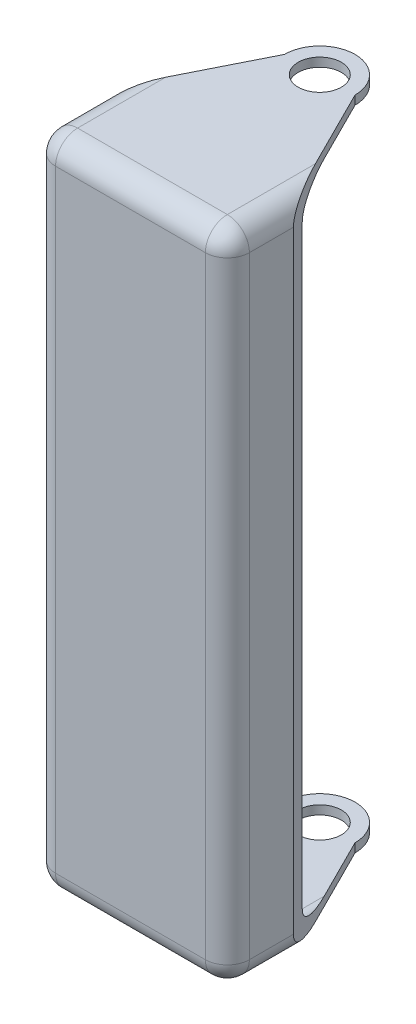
ISO-10303-21;
HEADER;
FILE_DESCRIPTION(('STEP AP214'),'2;1');
FILE_NAME('part.step','',(''),(''),'','','');
FILE_SCHEMA(('AUTOMOTIVE_DESIGN { 1 0 10303 214 1 1 1 1 }'));
ENDSEC;
DATA;
#1=APPLICATION_CONTEXT('core data for automotive mechanical design processes');
#2=APPLICATION_PROTOCOL_DEFINITION('international standard','automotive_design',2000,#1);
#3=PRODUCT_CONTEXT('',#1,'mechanical');
#4=PRODUCT('Part','Part','',(#3));
#5=PRODUCT_RELATED_PRODUCT_CATEGORY('part','',(#4));
#6=PRODUCT_DEFINITION_FORMATION('','',#4);
#7=PRODUCT_DEFINITION_CONTEXT('part definition',#1,'design');
#8=PRODUCT_DEFINITION('design','',#6,#7);
#9=PRODUCT_DEFINITION_SHAPE('','',#8);
#10=(LENGTH_UNIT() NAMED_UNIT(*) SI_UNIT(.MILLI.,.METRE.));
#11=(NAMED_UNIT(*) PLANE_ANGLE_UNIT() SI_UNIT($,.RADIAN.));
#12=(NAMED_UNIT(*) SI_UNIT($,.STERADIAN.) SOLID_ANGLE_UNIT());
#13=UNCERTAINTY_MEASURE_WITH_UNIT(LENGTH_MEASURE(1.E-05),#10,'distance_accuracy_value','');
#14=(GEOMETRIC_REPRESENTATION_CONTEXT(3) GLOBAL_UNCERTAINTY_ASSIGNED_CONTEXT((#13)) GLOBAL_UNIT_ASSIGNED_CONTEXT((#10,
#11,#12)) REPRESENTATION_CONTEXT('',''));
#15=CARTESIAN_POINT('',(0.,0.,0.));
#16=DIRECTION('',(0.,0.,1.));
#17=DIRECTION('',(1.,0.,0.));
#18=AXIS2_PLACEMENT_3D('',#15,#16,#17);
#19=CARTESIAN_POINT('',(20.3226286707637,184.15,5.88214452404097));
#20=DIRECTION('',(-0.894242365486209,0.,0.447583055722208));
#21=DIRECTION('',(0.447583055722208,0.,0.894242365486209));
#22=AXIS2_PLACEMENT_3D('',#19,#20,#21);
#23=PLANE('',#22);
#24=DIRECTION('',(0.,-1.,0.));
#25=VECTOR('',#24,1.);
#26=CARTESIAN_POINT('',(22.8626286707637,184.15,10.9569023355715));
#27=LINE('',#26,#25);
#28=CARTESIAN_POINT('',(22.8626286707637,180.34,10.9569023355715));
#29=VERTEX_POINT('',#28);
#30=CARTESIAN_POINT('',(22.8626286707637,3.81000000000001,10.9569023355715));
#31=VERTEX_POINT('',#30);
#32=EDGE_CURVE('E222',#29,#31,#27,.T.);
#33=ORIENTED_EDGE('',*,*,#32,.T.);
#34=CARTESIAN_POINT('',(16.5126286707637,3.81000000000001,-1.72999219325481));
#35=DIRECTION('',(-0.894242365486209,0.,0.447583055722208));
#36=DIRECTION('',(-0.447583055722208,0.,-0.894242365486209));
#37=AXIS2_PLACEMENT_3D('',#34,#35,#36);
#38=ELLIPSE('',#37,14.1873109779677,6.35);
#39=CARTESIAN_POINT('',(16.5126286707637,-2.53999999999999,-1.72999219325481));
#40=VERTEX_POINT('',#39);
#41=EDGE_CURVE('E327',#31,#40,#38,.F.);
#42=ORIENTED_EDGE('',*,*,#41,.T.);
#43=DIRECTION('',(-0.447583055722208,0.,-0.894242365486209));
#44=VECTOR('',#43,1.);
#45=CARTESIAN_POINT('',(20.3226286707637,-2.53999999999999,5.88214452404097));
#46=LINE('',#45,#44);
#47=CARTESIAN_POINT('',(5.08262867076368,-2.53999999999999,-24.5664023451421));
#48=VERTEX_POINT('',#47);
#49=EDGE_CURVE('E232',#40,#48,#46,.T.);
#50=ORIENTED_EDGE('',*,*,#49,.T.);
#51=DIRECTION('',(0.,-1.,0.));
#52=VECTOR('',#51,1.);
#53=CARTESIAN_POINT('',(5.08262867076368,184.15,-24.5664023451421));
#54=LINE('',#53,#52);
#55=CARTESIAN_POINT('',(5.08262867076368,0.,-24.5664023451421));
#56=VERTEX_POINT('',#55);
#57=EDGE_CURVE('E223',#56,#48,#54,.T.);
#58=ORIENTED_EDGE('',*,*,#57,.F.);
#59=DIRECTION('',(-0.447583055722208,0.,-0.894242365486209));
#60=VECTOR('',#59,1.);
#61=CARTESIAN_POINT('',(20.3226286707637,0.,5.88214452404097));
#62=LINE('',#61,#60);
#63=CARTESIAN_POINT('',(13.9726286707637,0.,-6.80475000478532));
#64=VERTEX_POINT('',#63);
#65=EDGE_CURVE('E459',#64,#56,#62,.T.);
#66=ORIENTED_EDGE('',*,*,#65,.F.);
#67=CARTESIAN_POINT('',(13.9726286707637,6.35,-6.80475000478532));
#68=DIRECTION('',(-0.894242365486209,0.,0.447583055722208));
#69=DIRECTION('',(0.447583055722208,0.,0.894242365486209));
#70=AXIS2_PLACEMENT_3D('',#67,#68,#69);
#71=ELLIPSE('',#70,14.1873109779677,6.35);
#72=CARTESIAN_POINT('',(20.3226286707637,6.34999999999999,5.88214452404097));
#73=VERTEX_POINT('',#72);
#74=EDGE_CURVE('E44',#64,#73,#71,.T.);
#75=ORIENTED_EDGE('',*,*,#74,.T.);
#76=DIRECTION('',(0.,-1.,0.));
#77=VECTOR('',#76,1.);
#78=CARTESIAN_POINT('',(20.3226286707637,184.15,5.88214452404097));
#79=LINE('',#78,#77);
#80=CARTESIAN_POINT('',(20.3226286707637,177.8,5.88214452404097));
#81=VERTEX_POINT('',#80);
#82=EDGE_CURVE('E235',#81,#73,#79,.T.);
#83=ORIENTED_EDGE('',*,*,#82,.F.);
#84=CARTESIAN_POINT('',(13.9726286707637,177.8,-6.80475000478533));
#85=DIRECTION('',(-0.894242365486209,0.,0.447583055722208));
#86=DIRECTION('',(-0.447583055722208,0.,-0.894242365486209));
#87=AXIS2_PLACEMENT_3D('',#84,#85,#86);
#88=ELLIPSE('',#87,14.1873109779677,6.35);
#89=CARTESIAN_POINT('',(13.9726286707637,184.15,-6.80475000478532));
#90=VERTEX_POINT('',#89);
#91=EDGE_CURVE('E206',#81,#90,#88,.T.);
#92=ORIENTED_EDGE('',*,*,#91,.T.);
#93=DIRECTION('',(-0.447583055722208,0.,-0.894242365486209));
#94=VECTOR('',#93,1.);
#95=CARTESIAN_POINT('',(20.3226286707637,184.15,5.88214452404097));
#96=LINE('',#95,#94);
#97=CARTESIAN_POINT('',(5.08262867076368,184.15,-24.5664023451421));
#98=VERTEX_POINT('',#97);
#99=EDGE_CURVE('E197',#90,#98,#96,.T.);
#100=ORIENTED_EDGE('',*,*,#99,.T.);
#101=CARTESIAN_POINT('',(5.08262867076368,186.69,-24.5664023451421));
#102=VERTEX_POINT('',#101);
#103=EDGE_CURVE('E202',#102,#98,#54,.T.);
#104=ORIENTED_EDGE('',*,*,#103,.F.);
#105=DIRECTION('',(-0.447583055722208,0.,-0.894242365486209));
#106=VECTOR('',#105,1.);
#107=CARTESIAN_POINT('',(20.3226286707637,186.69,5.88214452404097));
#108=LINE('',#107,#106);
#109=CARTESIAN_POINT('',(16.5126286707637,186.69,-1.72999219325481));
#110=VERTEX_POINT('',#109);
#111=EDGE_CURVE('E241',#110,#102,#108,.T.);
#112=ORIENTED_EDGE('',*,*,#111,.F.);
#113=CARTESIAN_POINT('',(16.5126286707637,180.34,-1.72999219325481));
#114=DIRECTION('',(-0.894242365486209,0.,0.447583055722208));
#115=DIRECTION('',(0.447583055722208,0.,0.894242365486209));
#116=AXIS2_PLACEMENT_3D('',#113,#114,#115);
#117=ELLIPSE('',#116,14.1873109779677,6.35);
#118=EDGE_CURVE('E325',#110,#29,#117,.F.);
#119=ORIENTED_EDGE('',*,*,#118,.T.);
#120=EDGE_LOOP('',(#33,#42,#50,#58,#66,#75,#83,#92,#100,#104,#112,#119));
#121=FACE_BOUND('',#120,.T.);
#122=ADVANCED_FACE('F35',(#121),#23,.F.);
#123=CARTESIAN_POINT('',(-5.07737132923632,184.15,-24.5664023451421));
#124=DIRECTION('',(0.,-1.,0.));
#125=DIRECTION('',(0.,0.,-1.));
#126=AXIS2_PLACEMENT_3D('',#123,#124,#125);
#127=CYLINDRICAL_SURFACE('',#126,10.16);
#128=CARTESIAN_POINT('',(-5.07737132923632,0.,-24.5664023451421));
#129=DIRECTION('',(0.,1.,0.));
#130=DIRECTION('',(0.,0.,1.));
#131=AXIS2_PLACEMENT_3D('',#128,#129,#130);
#132=CIRCLE('',#131,10.16);
#133=CARTESIAN_POINT('',(-15.2373713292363,0.,-24.5664023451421));
#134=VERTEX_POINT('',#133);
#135=EDGE_CURVE('E455',#56,#134,#132,.T.);
#136=ORIENTED_EDGE('',*,*,#135,.F.);
#137=ORIENTED_EDGE('',*,*,#57,.T.);
#138=CARTESIAN_POINT('',(-5.07737132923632,-2.53999999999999,-24.5664023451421));
#139=DIRECTION('',(0.,1.,0.));
#140=DIRECTION('',(0.,0.,1.));
#141=AXIS2_PLACEMENT_3D('',#138,#139,#140);
#142=CIRCLE('',#141,10.16);
#143=CARTESIAN_POINT('',(-15.2373713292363,-2.53999999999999,-24.5664023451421));
#144=VERTEX_POINT('',#143);
#145=EDGE_CURVE('E234',#48,#144,#142,.T.);
#146=ORIENTED_EDGE('',*,*,#145,.T.);
#147=DIRECTION('',(0.,-1.,0.));
#148=VECTOR('',#147,1.);
#149=CARTESIAN_POINT('',(-15.2373713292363,184.15,-24.5664023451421));
#150=LINE('',#149,#148);
#151=EDGE_CURVE('E245',#134,#144,#150,.T.);
#152=ORIENTED_EDGE('',*,*,#151,.F.);
#153=EDGE_LOOP('',(#136,#137,#146,#152));
#154=FACE_BOUND('',#153,.T.);
#155=ADVANCED_FACE('F453',(#154),#127,.T.);
#156=CARTESIAN_POINT('',(-15.2373713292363,184.15,-24.5664023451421));
#157=DIRECTION('',(0.894242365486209,0.,0.447583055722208));
#158=DIRECTION('',(0.447583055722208,0.,-0.894242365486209));
#159=AXIS2_PLACEMENT_3D('',#156,#157,#158);
#160=PLANE('',#159);
#161=DIRECTION('',(0.,-1.,0.));
#162=VECTOR('',#161,1.);
#163=CARTESIAN_POINT('',(-33.0173713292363,184.15,10.9569023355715));
#164=LINE('',#163,#162);
#165=CARTESIAN_POINT('',(-33.0173713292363,180.34,10.9569023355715));
#166=VERTEX_POINT('',#165);
#167=CARTESIAN_POINT('',(-33.0173713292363,3.81000000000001,10.9569023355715));
#168=VERTEX_POINT('',#167);
#169=EDGE_CURVE('E242',#166,#168,#164,.T.);
#170=ORIENTED_EDGE('',*,*,#169,.F.);
#171=CARTESIAN_POINT('',(-26.6673713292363,180.34,-1.7299921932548));
#172=DIRECTION('',(0.894242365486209,0.,0.447583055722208));
#173=DIRECTION('',(0.447583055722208,0.,-0.894242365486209));
#174=AXIS2_PLACEMENT_3D('',#171,#172,#173);
#175=ELLIPSE('',#174,14.1873109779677,6.35);
#176=CARTESIAN_POINT('',(-26.6673713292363,186.69,-1.7299921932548));
#177=VERTEX_POINT('',#176);
#178=EDGE_CURVE('E323',#166,#177,#175,.F.);
#179=ORIENTED_EDGE('',*,*,#178,.T.);
#180=DIRECTION('',(-0.447583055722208,0.,0.894242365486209));
#181=VECTOR('',#180,1.);
#182=CARTESIAN_POINT('',(-15.2373713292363,186.69,-24.5664023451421));
#183=LINE('',#182,#181);
#184=CARTESIAN_POINT('',(-15.2373713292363,186.69,-24.5664023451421));
#185=VERTEX_POINT('',#184);
#186=EDGE_CURVE('E246',#185,#177,#183,.T.);
#187=ORIENTED_EDGE('',*,*,#186,.F.);
#188=CARTESIAN_POINT('',(-15.2373713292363,184.15,-24.5664023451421));
#189=VERTEX_POINT('',#188);
#190=EDGE_CURVE('E228',#185,#189,#150,.T.);
#191=ORIENTED_EDGE('',*,*,#190,.T.);
#192=DIRECTION('',(-0.447583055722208,0.,0.894242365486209));
#193=VECTOR('',#192,1.);
#194=CARTESIAN_POINT('',(-15.2373713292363,184.15,-24.5664023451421));
#195=LINE('',#194,#193);
#196=CARTESIAN_POINT('',(-24.1273713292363,184.15,-6.80475000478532));
#197=VERTEX_POINT('',#196);
#198=EDGE_CURVE('E215',#189,#197,#195,.T.);
#199=ORIENTED_EDGE('',*,*,#198,.T.);
#200=CARTESIAN_POINT('',(-24.1273713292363,177.8,-6.80475000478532));
#201=DIRECTION('',(0.894242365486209,0.,0.447583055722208));
#202=DIRECTION('',(-0.447583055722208,0.,0.894242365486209));
#203=AXIS2_PLACEMENT_3D('',#200,#201,#202);
#204=ELLIPSE('',#203,14.1873109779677,6.35);
#205=CARTESIAN_POINT('',(-30.4773713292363,177.8,5.88214452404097));
#206=VERTEX_POINT('',#205);
#207=EDGE_CURVE('E11',#197,#206,#204,.T.);
#208=ORIENTED_EDGE('',*,*,#207,.T.);
#209=DIRECTION('',(0.,-1.,0.));
#210=VECTOR('',#209,1.);
#211=CARTESIAN_POINT('',(-30.4773713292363,184.15,5.88214452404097));
#212=LINE('',#211,#210);
#213=CARTESIAN_POINT('',(-30.4773713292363,6.34999999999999,5.88214452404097));
#214=VERTEX_POINT('',#213);
#215=EDGE_CURVE('E466',#206,#214,#212,.T.);
#216=ORIENTED_EDGE('',*,*,#215,.T.);
#217=CARTESIAN_POINT('',(-24.1273713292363,6.35,-6.80475000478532));
#218=DIRECTION('',(0.894242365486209,0.,0.447583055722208));
#219=DIRECTION('',(0.447583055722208,0.,-0.894242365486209));
#220=AXIS2_PLACEMENT_3D('',#217,#218,#219);
#221=ELLIPSE('',#220,14.1873109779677,6.35);
#222=CARTESIAN_POINT('',(-24.1273713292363,0.,-6.80475000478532));
#223=VERTEX_POINT('',#222);
#224=EDGE_CURVE('E330',#214,#223,#221,.T.);
#225=ORIENTED_EDGE('',*,*,#224,.T.);
#226=DIRECTION('',(-0.447583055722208,0.,0.894242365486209));
#227=VECTOR('',#226,1.);
#228=CARTESIAN_POINT('',(-15.2373713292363,0.,-24.5664023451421));
#229=LINE('',#228,#227);
#230=EDGE_CURVE('E210',#134,#223,#229,.T.);
#231=ORIENTED_EDGE('',*,*,#230,.F.);
#232=ORIENTED_EDGE('',*,*,#151,.T.);
#233=DIRECTION('',(-0.447583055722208,0.,0.894242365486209));
#234=VECTOR('',#233,1.);
#235=CARTESIAN_POINT('',(-15.2373713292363,-2.53999999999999,-24.5664023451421));
#236=LINE('',#235,#234);
#237=CARTESIAN_POINT('',(-26.6673713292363,-2.53999999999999,-1.7299921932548));
#238=VERTEX_POINT('',#237);
#239=EDGE_CURVE('E238',#144,#238,#236,.T.);
#240=ORIENTED_EDGE('',*,*,#239,.T.);
#241=CARTESIAN_POINT('',(-26.6673713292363,3.81000000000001,-1.7299921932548));
#242=DIRECTION('',(0.894242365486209,0.,0.447583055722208));
#243=DIRECTION('',(-0.447583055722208,0.,0.894242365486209));
#244=AXIS2_PLACEMENT_3D('',#241,#242,#243);
#245=ELLIPSE('',#244,14.1873109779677,6.35);
#246=EDGE_CURVE('E321',#238,#168,#245,.F.);
#247=ORIENTED_EDGE('',*,*,#246,.T.);
#248=EDGE_LOOP('',(#170,#179,#187,#191,#199,#208,#216,#225,#231,#232,#240,#247));
#249=FACE_BOUND('',#248,.T.);
#250=ADVANCED_FACE('F530',(#249),#160,.F.);
#251=CARTESIAN_POINT('',(22.8626286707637,184.15,5.88214452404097));
#252=DIRECTION('',(-1.,0.,0.));
#253=DIRECTION('',(0.,0.,1.));
#254=AXIS2_PLACEMENT_3D('',#251,#252,#253);
#255=PLANE('',#254);
#256=DIRECTION('',(0.,-1.,0.));
#257=VECTOR('',#256,1.);
#258=CARTESIAN_POINT('',(22.8626286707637,184.15,23.662144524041));
#259=LINE('',#258,#257);
#260=CARTESIAN_POINT('',(22.8626286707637,180.34,23.662144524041));
#261=VERTEX_POINT('',#260);
#262=CARTESIAN_POINT('',(22.8626286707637,3.81000000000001,23.662144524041));
#263=VERTEX_POINT('',#262);
#264=EDGE_CURVE('E52',#261,#263,#259,.T.);
#265=ORIENTED_EDGE('',*,*,#264,.T.);
#266=DIRECTION('',(0.,0.,-1.));
#267=VECTOR('',#266,1.);
#268=CARTESIAN_POINT('',(22.8626286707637,3.81000000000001,5.88214452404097));
#269=LINE('',#268,#267);
#270=EDGE_CURVE('E319',#263,#31,#269,.T.);
#271=ORIENTED_EDGE('',*,*,#270,.T.);
#272=ORIENTED_EDGE('',*,*,#32,.F.);
#273=DIRECTION('',(0.,0.,-1.));
#274=VECTOR('',#273,1.);
#275=CARTESIAN_POINT('',(22.8626286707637,180.34,30.012144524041));
#276=LINE('',#275,#274);
#277=EDGE_CURVE('E57',#29,#261,#276,.F.);
#278=ORIENTED_EDGE('',*,*,#277,.T.);
#279=EDGE_LOOP('',(#265,#271,#272,#278));
#280=FACE_BOUND('',#279,.T.);
#281=ADVANCED_FACE('F429',(#280),#255,.F.);
#282=ORIENTED_EDGE('',*,*,#103,.T.);
#283=CARTESIAN_POINT('',(-5.07737132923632,184.15,-24.5664023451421));
#284=DIRECTION('',(0.,1.,0.));
#285=DIRECTION('',(0.,0.,1.));
#286=AXIS2_PLACEMENT_3D('',#283,#284,#285);
#287=CIRCLE('',#286,10.16);
#288=EDGE_CURVE('E209',#98,#189,#287,.T.);
#289=ORIENTED_EDGE('',*,*,#288,.T.);
#290=ORIENTED_EDGE('',*,*,#190,.F.);
#291=CARTESIAN_POINT('',(-5.07737132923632,186.69,-24.5664023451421));
#292=DIRECTION('',(0.,1.,0.));
#293=DIRECTION('',(0.,0.,1.));
#294=AXIS2_PLACEMENT_3D('',#291,#292,#293);
#295=CIRCLE('',#294,10.16);
#296=EDGE_CURVE('E221',#102,#185,#295,.T.);
#297=ORIENTED_EDGE('',*,*,#296,.F.);
#298=EDGE_LOOP('',(#282,#289,#290,#297));
#299=FACE_BOUND('',#298,.T.);
#300=ADVANCED_FACE('F220',(#299),#127,.T.);
#301=CARTESIAN_POINT('',(-33.0173713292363,184.15,5.88214452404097));
#302=DIRECTION('',(1.,0.,0.));
#303=DIRECTION('',(0.,0.,-1.));
#304=AXIS2_PLACEMENT_3D('',#301,#302,#303);
#305=PLANE('',#304);
#306=DIRECTION('',(0.,-1.,0.));
#307=VECTOR('',#306,1.);
#308=CARTESIAN_POINT('',(-33.0173713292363,184.15,23.662144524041));
#309=LINE('',#308,#307);
#310=CARTESIAN_POINT('',(-33.0173713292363,3.81000000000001,23.662144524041));
#311=VERTEX_POINT('',#310);
#312=CARTESIAN_POINT('',(-33.0173713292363,180.34,23.662144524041));
#313=VERTEX_POINT('',#312);
#314=EDGE_CURVE('E307',#311,#313,#309,.F.);
#315=ORIENTED_EDGE('',*,*,#314,.T.);
#316=DIRECTION('',(0.,0.,1.));
#317=VECTOR('',#316,1.);
#318=CARTESIAN_POINT('',(-33.0173713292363,180.34,10.9569023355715));
#319=LINE('',#318,#317);
#320=EDGE_CURVE('E309',#313,#166,#319,.F.);
#321=ORIENTED_EDGE('',*,*,#320,.T.);
#322=ORIENTED_EDGE('',*,*,#169,.T.);
#323=DIRECTION('',(0.,0.,1.));
#324=VECTOR('',#323,1.);
#325=CARTESIAN_POINT('',(-33.0173713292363,3.81000000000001,5.88214452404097));
#326=LINE('',#325,#324);
#327=EDGE_CURVE('E305',#168,#311,#326,.T.);
#328=ORIENTED_EDGE('',*,*,#327,.T.);
#329=EDGE_LOOP('',(#315,#321,#322,#328));
#330=FACE_BOUND('',#329,.T.);
#331=ADVANCED_FACE('F557',(#330),#305,.F.);
#332=CARTESIAN_POINT('',(-30.4773713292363,184.15,30.012144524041));
#333=DIRECTION('',(0.,0.,-1.));
#334=DIRECTION('',(-1.,0.,0.));
#335=AXIS2_PLACEMENT_3D('',#332,#333,#334);
#336=PLANE('',#335);
#337=DIRECTION('',(0.,-1.,0.));
#338=VECTOR('',#337,1.);
#339=CARTESIAN_POINT('',(-26.6673713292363,184.15,30.012144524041));
#340=LINE('',#339,#338);
#341=CARTESIAN_POINT('',(-26.6673713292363,180.34,30.012144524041));
#342=VERTEX_POINT('',#341);
#343=CARTESIAN_POINT('',(-26.6673713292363,3.81000000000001,30.012144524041));
#344=VERTEX_POINT('',#343);
#345=EDGE_CURVE('E293',#342,#344,#340,.T.);
#346=ORIENTED_EDGE('',*,*,#345,.T.);
#347=DIRECTION('',(1.,0.,0.));
#348=VECTOR('',#347,1.);
#349=CARTESIAN_POINT('',(-30.4773713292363,3.81000000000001,30.012144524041));
#350=LINE('',#349,#348);
#351=CARTESIAN_POINT('',(16.5126286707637,3.81000000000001,30.012144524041));
#352=VERTEX_POINT('',#351);
#353=EDGE_CURVE('E295',#344,#352,#350,.T.);
#354=ORIENTED_EDGE('',*,*,#353,.T.);
#355=DIRECTION('',(0.,-1.,0.));
#356=VECTOR('',#355,1.);
#357=CARTESIAN_POINT('',(16.5126286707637,184.15,30.012144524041));
#358=LINE('',#357,#356);
#359=CARTESIAN_POINT('',(16.5126286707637,180.34,30.012144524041));
#360=VERTEX_POINT('',#359);
#361=EDGE_CURVE('E289',#352,#360,#358,.F.);
#362=ORIENTED_EDGE('',*,*,#361,.T.);
#363=DIRECTION('',(1.,0.,0.));
#364=VECTOR('',#363,1.);
#365=CARTESIAN_POINT('',(-33.0173713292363,180.34,30.012144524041));
#366=LINE('',#365,#364);
#367=EDGE_CURVE('E291',#360,#342,#366,.F.);
#368=ORIENTED_EDGE('',*,*,#367,.T.);
#369=EDGE_LOOP('',(#346,#354,#362,#368));
#370=FACE_BOUND('',#369,.T.);
#371=ADVANCED_FACE('F413',(#370),#336,.F.);
#372=CARTESIAN_POINT('',(-5.07737132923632,186.69,-24.5664023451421));
#373=DIRECTION('',(0.,1.,0.));
#374=DIRECTION('',(0.,0.,1.));
#375=AXIS2_PLACEMENT_3D('',#372,#373,#374);
#376=PLANE('',#375);
#377=CARTESIAN_POINT('',(-5.07737132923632,186.69,-24.5664023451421));
#378=DIRECTION('',(0.,1.,0.));
#379=DIRECTION('',(0.,0.,1.));
#380=AXIS2_PLACEMENT_3D('',#377,#378,#379);
#381=CIRCLE('',#380,6.22646089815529);
#382=CARTESIAN_POINT('',(-5.07737132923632,186.69,-18.3399414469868));
#383=VERTEX_POINT('',#382);
#384=EDGE_CURVE('E255',#383,#383,#381,.T.);
#385=ORIENTED_EDGE('',*,*,#384,.F.);
#386=EDGE_LOOP('',(#385));
#387=FACE_BOUND('',#386,.T.);
#388=ORIENTED_EDGE('',*,*,#186,.T.);
#389=DIRECTION('',(0.,0.,1.));
#390=VECTOR('',#389,1.);
#391=CARTESIAN_POINT('',(-26.6673713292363,186.69,30.012144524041));
#392=LINE('',#391,#390);
#393=CARTESIAN_POINT('',(-26.6673713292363,186.69,23.662144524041));
#394=VERTEX_POINT('',#393);
#395=EDGE_CURVE('E315',#177,#394,#392,.T.);
#396=ORIENTED_EDGE('',*,*,#395,.T.);
#397=DIRECTION('',(1.,0.,0.));
#398=VECTOR('',#397,1.);
#399=CARTESIAN_POINT('',(22.8626286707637,186.69,23.662144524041));
#400=LINE('',#399,#398);
#401=CARTESIAN_POINT('',(16.5126286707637,186.69,23.662144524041));
#402=VERTEX_POINT('',#401);
#403=EDGE_CURVE('E313',#394,#402,#400,.T.);
#404=ORIENTED_EDGE('',*,*,#403,.T.);
#405=DIRECTION('',(0.,0.,-1.));
#406=VECTOR('',#405,1.);
#407=CARTESIAN_POINT('',(16.5126286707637,186.69,10.9569023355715));
#408=LINE('',#407,#406);
#409=EDGE_CURVE('E311',#402,#110,#408,.T.);
#410=ORIENTED_EDGE('',*,*,#409,.T.);
#411=ORIENTED_EDGE('',*,*,#111,.T.);
#412=ORIENTED_EDGE('',*,*,#296,.T.);
#413=EDGE_LOOP('',(#388,#396,#404,#410,#411,#412));
#414=FACE_BOUND('',#413,.T.);
#415=ADVANCED_FACE('F423',(#387,#414),#376,.T.);
#416=CARTESIAN_POINT('',(-5.07737132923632,-2.54,-24.5664023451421));
#417=DIRECTION('',(0.,1.,0.));
#418=DIRECTION('',(0.,0.,1.));
#419=AXIS2_PLACEMENT_3D('',#416,#417,#418);
#420=PLANE('',#419);
#421=CARTESIAN_POINT('',(-5.07737132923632,-2.54,-24.5664023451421));
#422=DIRECTION('',(0.,1.,0.));
#423=DIRECTION('',(0.,0.,1.));
#424=AXIS2_PLACEMENT_3D('',#421,#422,#423);
#425=CIRCLE('',#424,6.22646089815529);
#426=CARTESIAN_POINT('',(-5.07737132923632,-2.54,-18.3399414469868));
#427=VERTEX_POINT('',#426);
#428=EDGE_CURVE('E462',#427,#427,#425,.T.);
#429=ORIENTED_EDGE('',*,*,#428,.T.);
#430=EDGE_LOOP('',(#429));
#431=FACE_BOUND('',#430,.T.);
#432=DIRECTION('',(1.,0.,0.));
#433=VECTOR('',#432,1.);
#434=CARTESIAN_POINT('',(-5.07737132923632,-2.54,23.662144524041));
#435=LINE('',#434,#433);
#436=CARTESIAN_POINT('',(16.5126286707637,-2.54,23.662144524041));
#437=VERTEX_POINT('',#436);
#438=CARTESIAN_POINT('',(-26.6673713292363,-2.54,23.662144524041));
#439=VERTEX_POINT('',#438);
#440=EDGE_CURVE('E300',#437,#439,#435,.F.);
#441=ORIENTED_EDGE('',*,*,#440,.T.);
#442=DIRECTION('',(0.,0.,1.));
#443=VECTOR('',#442,1.);
#444=CARTESIAN_POINT('',(-26.6673713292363,-2.54,-24.5664023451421));
#445=LINE('',#444,#443);
#446=EDGE_CURVE('E303',#439,#238,#445,.F.);
#447=ORIENTED_EDGE('',*,*,#446,.T.);
#448=ORIENTED_EDGE('',*,*,#239,.F.);
#449=ORIENTED_EDGE('',*,*,#145,.F.);
#450=ORIENTED_EDGE('',*,*,#49,.F.);
#451=DIRECTION('',(0.,0.,-1.));
#452=VECTOR('',#451,1.);
#453=CARTESIAN_POINT('',(16.5126286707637,-2.54,-24.5664023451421));
#454=LINE('',#453,#452);
#455=EDGE_CURVE('E298',#40,#437,#454,.F.);
#456=ORIENTED_EDGE('',*,*,#455,.T.);
#457=EDGE_LOOP('',(#441,#447,#448,#449,#450,#456));
#458=FACE_BOUND('',#457,.T.);
#459=ADVANCED_FACE('F444',(#431,#458),#420,.F.);
#460=CARTESIAN_POINT('',(20.3226286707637,184.15,5.88214452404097));
#461=DIRECTION('',(-1.,0.,0.));
#462=DIRECTION('',(0.,0.,1.));
#463=AXIS2_PLACEMENT_3D('',#460,#461,#462);
#464=PLANE('',#463);
#465=DIRECTION('',(0.,-1.,0.));
#466=VECTOR('',#465,1.);
#467=CARTESIAN_POINT('',(20.3226286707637,184.15,21.122144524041));
#468=LINE('',#467,#466);
#469=CARTESIAN_POINT('',(20.3226286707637,6.35,21.122144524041));
#470=VERTEX_POINT('',#469);
#471=CARTESIAN_POINT('',(20.3226286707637,177.8,21.122144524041));
#472=VERTEX_POINT('',#471);
#473=EDGE_CURVE('E266',#470,#472,#468,.F.);
#474=ORIENTED_EDGE('',*,*,#473,.T.);
#475=DIRECTION('',(0.,0.,-1.));
#476=VECTOR('',#475,1.);
#477=CARTESIAN_POINT('',(20.3226286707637,177.8,5.88214452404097));
#478=LINE('',#477,#476);
#479=EDGE_CURVE('E269',#472,#81,#478,.T.);
#480=ORIENTED_EDGE('',*,*,#479,.T.);
#481=ORIENTED_EDGE('',*,*,#82,.T.);
#482=DIRECTION('',(0.,0.,-1.));
#483=VECTOR('',#482,1.);
#484=CARTESIAN_POINT('',(20.3226286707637,6.35,27.472144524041));
#485=LINE('',#484,#483);
#486=EDGE_CURVE('E264',#73,#470,#485,.F.);
#487=ORIENTED_EDGE('',*,*,#486,.T.);
#488=EDGE_LOOP('',(#474,#480,#481,#487));
#489=FACE_BOUND('',#488,.T.);
#490=ADVANCED_FACE('F471',(#489),#464,.T.);
#491=CARTESIAN_POINT('',(-30.4773713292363,184.15,5.88214452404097));
#492=DIRECTION('',(1.,0.,0.));
#493=DIRECTION('',(0.,0.,-1.));
#494=AXIS2_PLACEMENT_3D('',#491,#492,#493);
#495=PLANE('',#494);
#496=DIRECTION('',(0.,-1.,0.));
#497=VECTOR('',#496,1.);
#498=CARTESIAN_POINT('',(-30.4773713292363,0.,21.122144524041));
#499=LINE('',#498,#497);
#500=CARTESIAN_POINT('',(-30.4773713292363,177.8,21.122144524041));
#501=VERTEX_POINT('',#500);
#502=CARTESIAN_POINT('',(-30.4773713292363,6.35,21.122144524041));
#503=VERTEX_POINT('',#502);
#504=EDGE_CURVE('E279',#501,#503,#499,.T.);
#505=ORIENTED_EDGE('',*,*,#504,.T.);
#506=DIRECTION('',(0.,0.,1.));
#507=VECTOR('',#506,1.);
#508=CARTESIAN_POINT('',(-30.4773713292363,6.35,5.88214452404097));
#509=LINE('',#508,#507);
#510=EDGE_CURVE('E281',#503,#214,#509,.F.);
#511=ORIENTED_EDGE('',*,*,#510,.T.);
#512=ORIENTED_EDGE('',*,*,#215,.F.);
#513=DIRECTION('',(0.,0.,1.));
#514=VECTOR('',#513,1.);
#515=CARTESIAN_POINT('',(-30.4773713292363,177.8,5.88214452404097));
#516=LINE('',#515,#514);
#517=EDGE_CURVE('E277',#206,#501,#516,.T.);
#518=ORIENTED_EDGE('',*,*,#517,.T.);
#519=EDGE_LOOP('',(#505,#511,#512,#518));
#520=FACE_BOUND('',#519,.T.);
#521=ADVANCED_FACE('F521',(#520),#495,.T.);
#522=CARTESIAN_POINT('',(-30.4773713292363,184.15,27.472144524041));
#523=DIRECTION('',(0.,0.,-1.));
#524=DIRECTION('',(-1.,0.,0.));
#525=AXIS2_PLACEMENT_3D('',#522,#523,#524);
#526=PLANE('',#525);
#527=DIRECTION('',(1.,0.,0.));
#528=VECTOR('',#527,1.);
#529=CARTESIAN_POINT('',(-30.4773713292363,177.8,27.472144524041));
#530=LINE('',#529,#528);
#531=CARTESIAN_POINT('',(-24.1273713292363,177.8,27.472144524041));
#532=VERTEX_POINT('',#531);
#533=CARTESIAN_POINT('',(13.9726286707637,177.8,27.472144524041));
#534=VERTEX_POINT('',#533);
#535=EDGE_CURVE('E259',#532,#534,#530,.T.);
#536=ORIENTED_EDGE('',*,*,#535,.T.);
#537=DIRECTION('',(0.,-1.,0.));
#538=VECTOR('',#537,1.);
#539=CARTESIAN_POINT('',(13.9726286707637,0.,27.472144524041));
#540=LINE('',#539,#538);
#541=CARTESIAN_POINT('',(13.9726286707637,6.35,27.472144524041));
#542=VERTEX_POINT('',#541);
#543=EDGE_CURVE('E261',#534,#542,#540,.T.);
#544=ORIENTED_EDGE('',*,*,#543,.T.);
#545=DIRECTION('',(1.,0.,0.));
#546=VECTOR('',#545,1.);
#547=CARTESIAN_POINT('',(-30.4773713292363,6.35,27.472144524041));
#548=LINE('',#547,#546);
#549=CARTESIAN_POINT('',(-24.1273713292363,6.35,27.472144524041));
#550=VERTEX_POINT('',#549);
#551=EDGE_CURVE('E225',#542,#550,#548,.F.);
#552=ORIENTED_EDGE('',*,*,#551,.T.);
#553=DIRECTION('',(0.,-1.,0.));
#554=VECTOR('',#553,1.);
#555=CARTESIAN_POINT('',(-24.1273713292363,184.15,27.472144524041));
#556=LINE('',#555,#554);
#557=EDGE_CURVE('E257',#550,#532,#556,.F.);
#558=ORIENTED_EDGE('',*,*,#557,.T.);
#559=EDGE_LOOP('',(#536,#544,#552,#558));
#560=FACE_BOUND('',#559,.T.);
#561=ADVANCED_FACE('F494',(#560),#526,.T.);
#562=CARTESIAN_POINT('',(-5.07737132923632,184.15,-24.5664023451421));
#563=DIRECTION('',(0.,1.,0.));
#564=DIRECTION('',(0.,0.,1.));
#565=AXIS2_PLACEMENT_3D('',#562,#563,#564);
#566=PLANE('',#565);
#567=CARTESIAN_POINT('',(-5.07737132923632,184.15,-24.5664023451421));
#568=DIRECTION('',(0.,1.,0.));
#569=DIRECTION('',(0.,0.,1.));
#570=AXIS2_PLACEMENT_3D('',#567,#568,#569);
#571=CIRCLE('',#570,6.22646089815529);
#572=CARTESIAN_POINT('',(-5.07737132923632,184.15,-18.3399414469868));
#573=VERTEX_POINT('',#572);
#574=EDGE_CURVE('E254',#573,#573,#571,.T.);
#575=ORIENTED_EDGE('',*,*,#574,.T.);
#576=EDGE_LOOP('',(#575));
#577=FACE_BOUND('',#576,.T.);
#578=ORIENTED_EDGE('',*,*,#99,.F.);
#579=DIRECTION('',(0.,0.,-1.));
#580=VECTOR('',#579,1.);
#581=CARTESIAN_POINT('',(13.9726286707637,184.15,-24.5664023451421));
#582=LINE('',#581,#580);
#583=CARTESIAN_POINT('',(13.9726286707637,184.15,21.122144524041));
#584=VERTEX_POINT('',#583);
#585=EDGE_CURVE('E275',#90,#584,#582,.F.);
#586=ORIENTED_EDGE('',*,*,#585,.T.);
#587=DIRECTION('',(1.,0.,0.));
#588=VECTOR('',#587,1.);
#589=CARTESIAN_POINT('',(-5.07737132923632,184.15,21.122144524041));
#590=LINE('',#589,#588);
#591=CARTESIAN_POINT('',(-24.1273713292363,184.15,21.122144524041));
#592=VERTEX_POINT('',#591);
#593=EDGE_CURVE('E273',#584,#592,#590,.F.);
#594=ORIENTED_EDGE('',*,*,#593,.T.);
#595=DIRECTION('',(0.,0.,1.));
#596=VECTOR('',#595,1.);
#597=CARTESIAN_POINT('',(-24.1273713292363,184.15,-24.5664023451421));
#598=LINE('',#597,#596);
#599=EDGE_CURVE('E271',#592,#197,#598,.F.);
#600=ORIENTED_EDGE('',*,*,#599,.T.);
#601=ORIENTED_EDGE('',*,*,#198,.F.);
#602=ORIENTED_EDGE('',*,*,#288,.F.);
#603=EDGE_LOOP('',(#578,#586,#594,#600,#601,#602));
#604=FACE_BOUND('',#603,.T.);
#605=ADVANCED_FACE('F213',(#577,#604),#566,.F.);
#606=CARTESIAN_POINT('',(-5.07737132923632,0.,-24.5664023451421));
#607=DIRECTION('',(0.,1.,0.));
#608=DIRECTION('',(0.,0.,1.));
#609=AXIS2_PLACEMENT_3D('',#606,#607,#608);
#610=PLANE('',#609);
#611=CARTESIAN_POINT('',(-5.07737132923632,0.,-24.5664023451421));
#612=DIRECTION('',(0.,1.,0.));
#613=DIRECTION('',(0.,0.,1.));
#614=AXIS2_PLACEMENT_3D('',#611,#612,#613);
#615=CIRCLE('',#614,6.22646089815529);
#616=CARTESIAN_POINT('',(-5.07737132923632,0.,-18.3399414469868));
#617=VERTEX_POINT('',#616);
#618=EDGE_CURVE('E251',#617,#617,#615,.T.);
#619=ORIENTED_EDGE('',*,*,#618,.F.);
#620=EDGE_LOOP('',(#619));
#621=FACE_BOUND('',#620,.T.);
#622=ORIENTED_EDGE('',*,*,#230,.T.);
#623=DIRECTION('',(0.,0.,1.));
#624=VECTOR('',#623,1.);
#625=CARTESIAN_POINT('',(-24.1273713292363,0.,27.472144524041));
#626=LINE('',#625,#624);
#627=CARTESIAN_POINT('',(-24.1273713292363,0.,21.122144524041));
#628=VERTEX_POINT('',#627);
#629=EDGE_CURVE('E287',#223,#628,#626,.T.);
#630=ORIENTED_EDGE('',*,*,#629,.T.);
#631=DIRECTION('',(1.,0.,0.));
#632=VECTOR('',#631,1.);
#633=CARTESIAN_POINT('',(20.3226286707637,0.,21.122144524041));
#634=LINE('',#633,#632);
#635=CARTESIAN_POINT('',(13.9726286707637,0.,21.122144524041));
#636=VERTEX_POINT('',#635);
#637=EDGE_CURVE('E285',#628,#636,#634,.T.);
#638=ORIENTED_EDGE('',*,*,#637,.T.);
#639=DIRECTION('',(0.,0.,-1.));
#640=VECTOR('',#639,1.);
#641=CARTESIAN_POINT('',(13.9726286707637,0.,5.88214452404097));
#642=LINE('',#641,#640);
#643=EDGE_CURVE('E283',#636,#64,#642,.T.);
#644=ORIENTED_EDGE('',*,*,#643,.T.);
#645=ORIENTED_EDGE('',*,*,#65,.T.);
#646=ORIENTED_EDGE('',*,*,#135,.T.);
#647=EDGE_LOOP('',(#622,#630,#638,#644,#645,#646));
#648=FACE_BOUND('',#647,.T.);
#649=ADVANCED_FACE('F531',(#621,#648),#610,.T.);
#650=CARTESIAN_POINT('',(-5.07737132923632,-3.81000000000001,-24.5664023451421));
#651=DIRECTION('',(0.,1.,0.));
#652=DIRECTION('',(0.,0.,1.));
#653=AXIS2_PLACEMENT_3D('',#650,#651,#652);
#654=CYLINDRICAL_SURFACE('',#653,6.22646089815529);
#655=ORIENTED_EDGE('',*,*,#618,.T.);
#656=EDGE_LOOP('',(#655));
#657=FACE_BOUND('',#656,.T.);
#658=ORIENTED_EDGE('',*,*,#428,.F.);
#659=EDGE_LOOP('',(#658));
#660=FACE_BOUND('',#659,.T.);
#661=ADVANCED_FACE('F533',(#657,#660),#654,.F.);
#662=ORIENTED_EDGE('',*,*,#384,.T.);
#663=EDGE_LOOP('',(#662));
#664=FACE_BOUND('',#663,.T.);
#665=ORIENTED_EDGE('',*,*,#574,.F.);
#666=EDGE_LOOP('',(#665));
#667=FACE_BOUND('',#666,.T.);
#668=ADVANCED_FACE('F540',(#664,#667),#654,.F.);
#669=CARTESIAN_POINT('',(-24.1273713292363,177.8,5.88214452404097));
#670=DIRECTION('',(0.,0.,1.));
#671=DIRECTION('',(1.,0.,0.));
#672=AXIS2_PLACEMENT_3D('',#669,#670,#671);
#673=CYLINDRICAL_SURFACE('',#672,6.35);
#674=ORIENTED_EDGE('',*,*,#207,.F.);
#675=ORIENTED_EDGE('',*,*,#599,.F.);
#676=CARTESIAN_POINT('',(-24.1273713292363,177.8,21.122144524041));
#677=DIRECTION('',(0.,0.,-1.));
#678=DIRECTION('',(-1.,0.,0.));
#679=AXIS2_PLACEMENT_3D('',#676,#677,#678);
#680=CIRCLE('',#679,6.35);
#681=EDGE_CURVE('E364',#501,#592,#680,.T.);
#682=ORIENTED_EDGE('',*,*,#681,.F.);
#683=ORIENTED_EDGE('',*,*,#517,.F.);
#684=EDGE_LOOP('',(#674,#675,#682,#683));
#685=FACE_BOUND('',#684,.T.);
#686=ADVANCED_FACE('F510',(#685),#673,.F.);
#687=CARTESIAN_POINT('',(-24.1273713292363,184.15,21.122144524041));
#688=DIRECTION('',(0.,1.,0.));
#689=DIRECTION('',(0.,0.,1.));
#690=AXIS2_PLACEMENT_3D('',#687,#688,#689);
#691=CYLINDRICAL_SURFACE('',#690,6.35);
#692=CARTESIAN_POINT('',(-24.1273713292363,6.35,21.122144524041));
#693=DIRECTION('',(0.,1.,0.));
#694=DIRECTION('',(0.,0.,1.));
#695=AXIS2_PLACEMENT_3D('',#692,#693,#694);
#696=CIRCLE('',#695,6.35);
#697=EDGE_CURVE('E358',#503,#550,#696,.T.);
#698=ORIENTED_EDGE('',*,*,#697,.F.);
#699=ORIENTED_EDGE('',*,*,#504,.F.);
#700=CARTESIAN_POINT('',(-24.1273713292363,177.8,21.122144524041));
#701=DIRECTION('',(0.,-1.,0.));
#702=DIRECTION('',(0.,0.,-1.));
#703=AXIS2_PLACEMENT_3D('',#700,#701,#702);
#704=CIRCLE('',#703,6.35);
#705=EDGE_CURVE('E361',#532,#501,#704,.T.);
#706=ORIENTED_EDGE('',*,*,#705,.F.);
#707=ORIENTED_EDGE('',*,*,#557,.F.);
#708=EDGE_LOOP('',(#698,#699,#706,#707));
#709=FACE_BOUND('',#708,.T.);
#710=ADVANCED_FACE('F518',(#709),#691,.F.);
#711=CARTESIAN_POINT('',(-24.1273713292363,6.35,-24.5664023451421));
#712=DIRECTION('',(0.,0.,-1.));
#713=DIRECTION('',(-1.,0.,0.));
#714=AXIS2_PLACEMENT_3D('',#711,#712,#713);
#715=CYLINDRICAL_SURFACE('',#714,6.35);
#716=ORIENTED_EDGE('',*,*,#224,.F.);
#717=ORIENTED_EDGE('',*,*,#510,.F.);
#718=CARTESIAN_POINT('',(-24.1273713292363,6.35,21.122144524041));
#719=DIRECTION('',(0.,0.,-1.));
#720=DIRECTION('',(-1.,0.,0.));
#721=AXIS2_PLACEMENT_3D('',#718,#719,#720);
#722=CIRCLE('',#721,6.35);
#723=EDGE_CURVE('E355',#628,#503,#722,.T.);
#724=ORIENTED_EDGE('',*,*,#723,.F.);
#725=ORIENTED_EDGE('',*,*,#629,.F.);
#726=EDGE_LOOP('',(#716,#717,#724,#725));
#727=FACE_BOUND('',#726,.T.);
#728=ADVANCED_FACE('F526',(#727),#715,.F.);
#729=CARTESIAN_POINT('',(-24.1273713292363,177.8,21.122144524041));
#730=DIRECTION('',(0.,0.,1.));
#731=DIRECTION('',(1.,0.,0.));
#732=AXIS2_PLACEMENT_3D('',#729,#730,#731);
#733=SPHERICAL_SURFACE('',#732,6.35);
#734=ORIENTED_EDGE('',*,*,#705,.T.);
#735=ORIENTED_EDGE('',*,*,#681,.T.);
#736=CARTESIAN_POINT('',(-24.1273713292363,177.8,21.122144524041));
#737=DIRECTION('',(1.,0.,0.));
#738=DIRECTION('',(0.,0.,-1.));
#739=AXIS2_PLACEMENT_3D('',#736,#737,#738);
#740=CIRCLE('',#739,6.35);
#741=EDGE_CURVE('E352',#532,#592,#740,.F.);
#742=ORIENTED_EDGE('',*,*,#741,.F.);
#743=EDGE_LOOP('',(#734,#735,#742));
#744=FACE_BOUND('',#743,.T.);
#745=ADVANCED_FACE('F514',(#744),#733,.F.);
#746=CARTESIAN_POINT('',(-24.1273713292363,6.35,21.122144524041));
#747=DIRECTION('',(0.,0.,1.));
#748=DIRECTION('',(1.,0.,0.));
#749=AXIS2_PLACEMENT_3D('',#746,#747,#748);
#750=SPHERICAL_SURFACE('',#749,6.35);
#751=ORIENTED_EDGE('',*,*,#723,.T.);
#752=ORIENTED_EDGE('',*,*,#697,.T.);
#753=CARTESIAN_POINT('',(-24.1273713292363,6.35,21.122144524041));
#754=DIRECTION('',(1.,0.,0.));
#755=DIRECTION('',(0.,0.,-1.));
#756=AXIS2_PLACEMENT_3D('',#753,#754,#755);
#757=CIRCLE('',#756,6.35);
#758=EDGE_CURVE('E349',#628,#550,#757,.F.);
#759=ORIENTED_EDGE('',*,*,#758,.F.);
#760=EDGE_LOOP('',(#751,#752,#759));
#761=FACE_BOUND('',#760,.T.);
#762=ADVANCED_FACE('F583',(#761),#750,.F.);
#763=CARTESIAN_POINT('',(13.9726286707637,177.8,5.88214452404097));
#764=DIRECTION('',(0.,0.,-1.));
#765=DIRECTION('',(-1.,0.,0.));
#766=AXIS2_PLACEMENT_3D('',#763,#764,#765);
#767=CYLINDRICAL_SURFACE('',#766,6.35);
#768=ORIENTED_EDGE('',*,*,#91,.F.);
#769=ORIENTED_EDGE('',*,*,#479,.F.);
#770=CARTESIAN_POINT('',(13.9726286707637,177.8,21.122144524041));
#771=DIRECTION('',(0.,0.,-1.));
#772=DIRECTION('',(-1.,0.,0.));
#773=AXIS2_PLACEMENT_3D('',#770,#771,#772);
#774=CIRCLE('',#773,6.35);
#775=EDGE_CURVE('E346',#584,#472,#774,.T.);
#776=ORIENTED_EDGE('',*,*,#775,.F.);
#777=ORIENTED_EDGE('',*,*,#585,.F.);
#778=EDGE_LOOP('',(#768,#769,#776,#777));
#779=FACE_BOUND('',#778,.T.);
#780=ADVANCED_FACE('F505',(#779),#767,.F.);
#781=CARTESIAN_POINT('',(-30.4773713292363,177.8,21.122144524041));
#782=DIRECTION('',(1.,0.,0.));
#783=DIRECTION('',(0.,0.,-1.));
#784=AXIS2_PLACEMENT_3D('',#781,#782,#783);
#785=CYLINDRICAL_SURFACE('',#784,6.35);
#786=ORIENTED_EDGE('',*,*,#741,.T.);
#787=ORIENTED_EDGE('',*,*,#593,.F.);
#788=CARTESIAN_POINT('',(13.9726286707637,177.8,21.122144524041));
#789=DIRECTION('',(-1.,0.,0.));
#790=DIRECTION('',(0.,-1.,0.));
#791=AXIS2_PLACEMENT_3D('',#788,#789,#790);
#792=CIRCLE('',#791,6.35);
#793=EDGE_CURVE('E343',#534,#584,#792,.T.);
#794=ORIENTED_EDGE('',*,*,#793,.F.);
#795=ORIENTED_EDGE('',*,*,#535,.F.);
#796=EDGE_LOOP('',(#786,#787,#794,#795));
#797=FACE_BOUND('',#796,.T.);
#798=ADVANCED_FACE('F500',(#797),#785,.F.);
#799=CARTESIAN_POINT('',(-5.07737132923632,6.35,21.122144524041));
#800=DIRECTION('',(-1.,0.,0.));
#801=DIRECTION('',(0.,0.,1.));
#802=AXIS2_PLACEMENT_3D('',#799,#800,#801);
#803=CYLINDRICAL_SURFACE('',#802,6.35);
#804=ORIENTED_EDGE('',*,*,#758,.T.);
#805=ORIENTED_EDGE('',*,*,#551,.F.);
#806=CARTESIAN_POINT('',(13.9726286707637,6.35,21.122144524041));
#807=DIRECTION('',(-1.,0.,0.));
#808=DIRECTION('',(0.,0.,1.));
#809=AXIS2_PLACEMENT_3D('',#806,#807,#808);
#810=CIRCLE('',#809,6.35);
#811=EDGE_CURVE('E340',#636,#542,#810,.T.);
#812=ORIENTED_EDGE('',*,*,#811,.F.);
#813=ORIENTED_EDGE('',*,*,#637,.F.);
#814=EDGE_LOOP('',(#804,#805,#812,#813));
#815=FACE_BOUND('',#814,.T.);
#816=ADVANCED_FACE('F490',(#815),#803,.F.);
#817=CARTESIAN_POINT('',(13.9726286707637,6.35,-24.5664023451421));
#818=DIRECTION('',(0.,0.,1.));
#819=DIRECTION('',(1.,0.,0.));
#820=AXIS2_PLACEMENT_3D('',#817,#818,#819);
#821=CYLINDRICAL_SURFACE('',#820,6.35);
#822=ORIENTED_EDGE('',*,*,#74,.F.);
#823=ORIENTED_EDGE('',*,*,#643,.F.);
#824=CARTESIAN_POINT('',(13.9726286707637,6.35,21.122144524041));
#825=DIRECTION('',(0.,0.,-1.));
#826=DIRECTION('',(0.,1.,0.));
#827=AXIS2_PLACEMENT_3D('',#824,#825,#826);
#828=CIRCLE('',#827,6.35);
#829=EDGE_CURVE('E337',#470,#636,#828,.T.);
#830=ORIENTED_EDGE('',*,*,#829,.F.);
#831=ORIENTED_EDGE('',*,*,#486,.F.);
#832=EDGE_LOOP('',(#822,#823,#830,#831));
#833=FACE_BOUND('',#832,.T.);
#834=ADVANCED_FACE('F476',(#833),#821,.F.);
#835=CARTESIAN_POINT('',(13.9726286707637,177.8,21.122144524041));
#836=DIRECTION('',(0.,0.,1.));
#837=DIRECTION('',(1.,0.,0.));
#838=AXIS2_PLACEMENT_3D('',#835,#836,#837);
#839=SPHERICAL_SURFACE('',#838,6.35);
#840=ORIENTED_EDGE('',*,*,#793,.T.);
#841=ORIENTED_EDGE('',*,*,#775,.T.);
#842=CARTESIAN_POINT('',(13.9726286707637,177.8,21.122144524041));
#843=DIRECTION('',(0.,-1.,0.));
#844=DIRECTION('',(0.,0.,-1.));
#845=AXIS2_PLACEMENT_3D('',#842,#843,#844);
#846=CIRCLE('',#845,6.35);
#847=EDGE_CURVE('E335',#534,#472,#846,.F.);
#848=ORIENTED_EDGE('',*,*,#847,.F.);
#849=EDGE_LOOP('',(#840,#841,#848));
#850=FACE_BOUND('',#849,.T.);
#851=ADVANCED_FACE('F503',(#850),#839,.F.);
#852=CARTESIAN_POINT('',(13.9726286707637,6.35,21.122144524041));
#853=DIRECTION('',(0.,0.,1.));
#854=DIRECTION('',(1.,0.,0.));
#855=AXIS2_PLACEMENT_3D('',#852,#853,#854);
#856=SPHERICAL_SURFACE('',#855,6.35);
#857=ORIENTED_EDGE('',*,*,#829,.T.);
#858=ORIENTED_EDGE('',*,*,#811,.T.);
#859=CARTESIAN_POINT('',(13.9726286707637,6.35,21.122144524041));
#860=DIRECTION('',(0.,1.,0.));
#861=DIRECTION('',(0.,0.,1.));
#862=AXIS2_PLACEMENT_3D('',#859,#860,#861);
#863=CIRCLE('',#862,6.35);
#864=EDGE_CURVE('E333',#470,#542,#863,.F.);
#865=ORIENTED_EDGE('',*,*,#864,.F.);
#866=EDGE_LOOP('',(#857,#858,#865));
#867=FACE_BOUND('',#866,.T.);
#868=ADVANCED_FACE('F486',(#867),#856,.F.);
#869=CARTESIAN_POINT('',(13.9726286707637,184.15,21.122144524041));
#870=DIRECTION('',(0.,1.,0.));
#871=DIRECTION('',(0.,0.,1.));
#872=AXIS2_PLACEMENT_3D('',#869,#870,#871);
#873=CYLINDRICAL_SURFACE('',#872,6.35);
#874=ORIENTED_EDGE('',*,*,#847,.T.);
#875=ORIENTED_EDGE('',*,*,#473,.F.);
#876=ORIENTED_EDGE('',*,*,#864,.T.);
#877=ORIENTED_EDGE('',*,*,#543,.F.);
#878=EDGE_LOOP('',(#874,#875,#876,#877));
#879=FACE_BOUND('',#878,.T.);
#880=ADVANCED_FACE('F483',(#879),#873,.F.);
#881=CARTESIAN_POINT('',(-26.6673713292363,180.34,-24.5664023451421));
#882=DIRECTION('',(0.,0.,-1.));
#883=DIRECTION('',(-1.,0.,0.));
#884=AXIS2_PLACEMENT_3D('',#881,#882,#883);
#885=CYLINDRICAL_SURFACE('',#884,6.35);
#886=ORIENTED_EDGE('',*,*,#178,.F.);
#887=ORIENTED_EDGE('',*,*,#320,.F.);
#888=CARTESIAN_POINT('',(-26.6673713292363,180.34,23.662144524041));
#889=DIRECTION('',(0.,0.,1.));
#890=DIRECTION('',(1.,0.,0.));
#891=AXIS2_PLACEMENT_3D('',#888,#889,#890);
#892=CIRCLE('',#891,6.35);
#893=EDGE_CURVE('E39',#394,#313,#892,.T.);
#894=ORIENTED_EDGE('',*,*,#893,.F.);
#895=ORIENTED_EDGE('',*,*,#395,.F.);
#896=EDGE_LOOP('',(#886,#887,#894,#895));
#897=FACE_BOUND('',#896,.T.);
#898=ADVANCED_FACE('F37',(#897),#885,.T.);
#899=CARTESIAN_POINT('',(-5.07737132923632,180.34,23.662144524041));
#900=DIRECTION('',(-1.,0.,0.));
#901=DIRECTION('',(0.,0.,1.));
#902=AXIS2_PLACEMENT_3D('',#899,#900,#901);
#903=CYLINDRICAL_SURFACE('',#902,6.35);
#904=CARTESIAN_POINT('',(16.5126286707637,180.34,23.662144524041));
#905=DIRECTION('',(1.,0.,0.));
#906=DIRECTION('',(0.,0.,-1.));
#907=AXIS2_PLACEMENT_3D('',#904,#905,#906);
#908=CIRCLE('',#907,6.35);
#909=EDGE_CURVE('E392',#402,#360,#908,.T.);
#910=ORIENTED_EDGE('',*,*,#909,.F.);
#911=ORIENTED_EDGE('',*,*,#403,.F.);
#912=CARTESIAN_POINT('',(-26.6673713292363,180.34,23.662144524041));
#913=DIRECTION('',(-1.,0.,0.));
#914=DIRECTION('',(0.,0.,1.));
#915=AXIS2_PLACEMENT_3D('',#912,#913,#914);
#916=CIRCLE('',#915,6.35);
#917=EDGE_CURVE('E394',#342,#394,#916,.T.);
#918=ORIENTED_EDGE('',*,*,#917,.F.);
#919=ORIENTED_EDGE('',*,*,#367,.F.);
#920=EDGE_LOOP('',(#910,#911,#918,#919));
#921=FACE_BOUND('',#920,.T.);
#922=ADVANCED_FACE('F420',(#921),#903,.T.);
#923=CARTESIAN_POINT('',(16.5126286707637,180.34,-24.5664023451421));
#924=DIRECTION('',(0.,0.,1.));
#925=DIRECTION('',(1.,0.,0.));
#926=AXIS2_PLACEMENT_3D('',#923,#924,#925);
#927=CYLINDRICAL_SURFACE('',#926,6.35);
#928=ORIENTED_EDGE('',*,*,#118,.F.);
#929=ORIENTED_EDGE('',*,*,#409,.F.);
#930=CARTESIAN_POINT('',(16.5126286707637,180.34,23.662144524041));
#931=DIRECTION('',(0.,0.,1.));
#932=DIRECTION('',(0.,-1.,0.));
#933=AXIS2_PLACEMENT_3D('',#930,#931,#932);
#934=CIRCLE('',#933,6.35);
#935=EDGE_CURVE('E389',#261,#402,#934,.T.);
#936=ORIENTED_EDGE('',*,*,#935,.F.);
#937=ORIENTED_EDGE('',*,*,#277,.F.);
#938=EDGE_LOOP('',(#928,#929,#936,#937));
#939=FACE_BOUND('',#938,.T.);
#940=ADVANCED_FACE('F426',(#939),#927,.T.);
#941=CARTESIAN_POINT('',(-26.6673713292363,180.34,23.662144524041));
#942=DIRECTION('',(0.,0.,1.));
#943=DIRECTION('',(1.,0.,0.));
#944=AXIS2_PLACEMENT_3D('',#941,#942,#943);
#945=SPHERICAL_SURFACE('',#944,6.35);
#946=ORIENTED_EDGE('',*,*,#917,.T.);
#947=ORIENTED_EDGE('',*,*,#893,.T.);
#948=CARTESIAN_POINT('',(-26.6673713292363,180.34,23.662144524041));
#949=DIRECTION('',(0.,1.,0.));
#950=DIRECTION('',(0.,0.,1.));
#951=AXIS2_PLACEMENT_3D('',#948,#949,#950);
#952=CIRCLE('',#951,6.35);
#953=EDGE_CURVE('E386',#342,#313,#952,.F.);
#954=ORIENTED_EDGE('',*,*,#953,.F.);
#955=EDGE_LOOP('',(#946,#947,#954));
#956=FACE_BOUND('',#955,.T.);
#957=ADVANCED_FACE('F401',(#956),#945,.T.);
#958=CARTESIAN_POINT('',(16.5126286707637,180.34,23.662144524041));
#959=DIRECTION('',(0.,0.,1.));
#960=DIRECTION('',(1.,0.,0.));
#961=AXIS2_PLACEMENT_3D('',#958,#959,#960);
#962=SPHERICAL_SURFACE('',#961,6.35);
#963=ORIENTED_EDGE('',*,*,#935,.T.);
#964=ORIENTED_EDGE('',*,*,#909,.T.);
#965=CARTESIAN_POINT('',(16.5126286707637,180.34,23.662144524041));
#966=DIRECTION('',(0.,1.,0.));
#967=DIRECTION('',(0.,0.,1.));
#968=AXIS2_PLACEMENT_3D('',#965,#966,#967);
#969=CIRCLE('',#968,6.35);
#970=EDGE_CURVE('E383',#261,#360,#969,.F.);
#971=ORIENTED_EDGE('',*,*,#970,.F.);
#972=EDGE_LOOP('',(#963,#964,#971));
#973=FACE_BOUND('',#972,.T.);
#974=ADVANCED_FACE('F612',(#973),#962,.T.);
#975=CARTESIAN_POINT('',(-26.6673713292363,3.81000000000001,5.88214452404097));
#976=DIRECTION('',(0.,0.,1.));
#977=DIRECTION('',(1.,0.,0.));
#978=AXIS2_PLACEMENT_3D('',#975,#976,#977);
#979=CYLINDRICAL_SURFACE('',#978,6.35);
#980=ORIENTED_EDGE('',*,*,#246,.F.);
#981=ORIENTED_EDGE('',*,*,#446,.F.);
#982=CARTESIAN_POINT('',(-26.6673713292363,3.81000000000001,23.662144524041));
#983=DIRECTION('',(0.,0.,1.));
#984=DIRECTION('',(1.,0.,0.));
#985=AXIS2_PLACEMENT_3D('',#982,#983,#984);
#986=CIRCLE('',#985,6.35);
#987=EDGE_CURVE('E380',#311,#439,#986,.T.);
#988=ORIENTED_EDGE('',*,*,#987,.F.);
#989=ORIENTED_EDGE('',*,*,#327,.F.);
#990=EDGE_LOOP('',(#980,#981,#988,#989));
#991=FACE_BOUND('',#990,.T.);
#992=ADVANCED_FACE('F609',(#991),#979,.T.);
#993=CARTESIAN_POINT('',(-26.6673713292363,184.15,23.662144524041));
#994=DIRECTION('',(0.,-1.,0.));
#995=DIRECTION('',(0.,0.,-1.));
#996=AXIS2_PLACEMENT_3D('',#993,#994,#995);
#997=CYLINDRICAL_SURFACE('',#996,6.35);
#998=ORIENTED_EDGE('',*,*,#953,.T.);
#999=ORIENTED_EDGE('',*,*,#314,.F.);
#1000=CARTESIAN_POINT('',(-26.6673713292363,3.81000000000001,23.662144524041));
#1001=DIRECTION('',(0.,-1.,0.));
#1002=DIRECTION('',(0.,0.,-1.));
#1003=AXIS2_PLACEMENT_3D('',#1000,#1001,#1002);
#1004=CIRCLE('',#1003,6.35);
#1005=EDGE_CURVE('E377',#344,#311,#1004,.T.);
#1006=ORIENTED_EDGE('',*,*,#1005,.F.);
#1007=ORIENTED_EDGE('',*,*,#345,.F.);
#1008=EDGE_LOOP('',(#998,#999,#1006,#1007));
#1009=FACE_BOUND('',#1008,.T.);
#1010=ADVANCED_FACE('F408',(#1009),#997,.T.);
#1011=CARTESIAN_POINT('',(16.5126286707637,184.15,23.662144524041));
#1012=DIRECTION('',(0.,-1.,0.));
#1013=DIRECTION('',(0.,0.,-1.));
#1014=AXIS2_PLACEMENT_3D('',#1011,#1012,#1013);
#1015=CYLINDRICAL_SURFACE('',#1014,6.35);
#1016=ORIENTED_EDGE('',*,*,#970,.T.);
#1017=ORIENTED_EDGE('',*,*,#361,.F.);
#1018=CARTESIAN_POINT('',(16.5126286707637,3.81000000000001,23.662144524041));
#1019=DIRECTION('',(0.,-1.,0.));
#1020=DIRECTION('',(0.,0.,-1.));
#1021=AXIS2_PLACEMENT_3D('',#1018,#1019,#1020);
#1022=CIRCLE('',#1021,6.35);
#1023=EDGE_CURVE('E374',#263,#352,#1022,.T.);
#1024=ORIENTED_EDGE('',*,*,#1023,.F.);
#1025=ORIENTED_EDGE('',*,*,#264,.F.);
#1026=EDGE_LOOP('',(#1016,#1017,#1024,#1025));
#1027=FACE_BOUND('',#1026,.T.);
#1028=ADVANCED_FACE('F437',(#1027),#1015,.T.);
#1029=CARTESIAN_POINT('',(16.5126286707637,3.81000000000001,5.88214452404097));
#1030=DIRECTION('',(0.,0.,-1.));
#1031=DIRECTION('',(-1.,0.,0.));
#1032=AXIS2_PLACEMENT_3D('',#1029,#1030,#1031);
#1033=CYLINDRICAL_SURFACE('',#1032,6.35);
#1034=ORIENTED_EDGE('',*,*,#41,.F.);
#1035=ORIENTED_EDGE('',*,*,#270,.F.);
#1036=CARTESIAN_POINT('',(16.5126286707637,3.81,23.662144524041));
#1037=DIRECTION('',(0.,0.,1.));
#1038=DIRECTION('',(1.,0.,0.));
#1039=AXIS2_PLACEMENT_3D('',#1036,#1037,#1038);
#1040=CIRCLE('',#1039,6.35);
#1041=EDGE_CURVE('E371',#437,#263,#1040,.T.);
#1042=ORIENTED_EDGE('',*,*,#1041,.F.);
#1043=ORIENTED_EDGE('',*,*,#455,.F.);
#1044=EDGE_LOOP('',(#1034,#1035,#1042,#1043));
#1045=FACE_BOUND('',#1044,.T.);
#1046=ADVANCED_FACE('F433',(#1045),#1033,.T.);
#1047=CARTESIAN_POINT('',(-26.6673713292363,3.81,23.662144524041));
#1048=DIRECTION('',(0.,0.,1.));
#1049=DIRECTION('',(1.,0.,0.));
#1050=AXIS2_PLACEMENT_3D('',#1047,#1048,#1049);
#1051=SPHERICAL_SURFACE('',#1050,6.35);
#1052=ORIENTED_EDGE('',*,*,#1005,.T.);
#1053=ORIENTED_EDGE('',*,*,#987,.T.);
#1054=CARTESIAN_POINT('',(-26.6673713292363,3.81,23.662144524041));
#1055=DIRECTION('',(-1.,0.,0.));
#1056=DIRECTION('',(0.,0.,1.));
#1057=AXIS2_PLACEMENT_3D('',#1054,#1055,#1056);
#1058=CIRCLE('',#1057,6.35);
#1059=EDGE_CURVE('E369',#344,#439,#1058,.F.);
#1060=ORIENTED_EDGE('',*,*,#1059,.F.);
#1061=EDGE_LOOP('',(#1052,#1053,#1060));
#1062=FACE_BOUND('',#1061,.T.);
#1063=ADVANCED_FACE('F599',(#1062),#1051,.T.);
#1064=CARTESIAN_POINT('',(16.5126286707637,3.81,23.662144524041));
#1065=DIRECTION('',(0.,0.,1.));
#1066=DIRECTION('',(1.,0.,0.));
#1067=AXIS2_PLACEMENT_3D('',#1064,#1065,#1066);
#1068=SPHERICAL_SURFACE('',#1067,6.35);
#1069=ORIENTED_EDGE('',*,*,#1041,.T.);
#1070=ORIENTED_EDGE('',*,*,#1023,.T.);
#1071=CARTESIAN_POINT('',(16.5126286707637,3.81000000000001,23.662144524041));
#1072=DIRECTION('',(1.,0.,0.));
#1073=DIRECTION('',(0.,0.,-1.));
#1074=AXIS2_PLACEMENT_3D('',#1071,#1072,#1073);
#1075=CIRCLE('',#1074,6.35);
#1076=EDGE_CURVE('E367',#437,#352,#1075,.F.);
#1077=ORIENTED_EDGE('',*,*,#1076,.F.);
#1078=EDGE_LOOP('',(#1069,#1070,#1077));
#1079=FACE_BOUND('',#1078,.T.);
#1080=ADVANCED_FACE('F440',(#1079),#1068,.T.);
#1081=CARTESIAN_POINT('',(-30.4773713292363,3.81000000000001,23.662144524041));
#1082=DIRECTION('',(1.,0.,0.));
#1083=DIRECTION('',(0.,0.,-1.));
#1084=AXIS2_PLACEMENT_3D('',#1081,#1082,#1083);
#1085=CYLINDRICAL_SURFACE('',#1084,6.35);
#1086=ORIENTED_EDGE('',*,*,#1059,.T.);
#1087=ORIENTED_EDGE('',*,*,#440,.F.);
#1088=ORIENTED_EDGE('',*,*,#1076,.T.);
#1089=ORIENTED_EDGE('',*,*,#353,.F.);
#1090=EDGE_LOOP('',(#1086,#1087,#1088,#1089));
#1091=FACE_BOUND('',#1090,.T.);
#1092=ADVANCED_FACE('F442',(#1091),#1085,.T.);
#1093=CLOSED_SHELL('',(#122,#155,#250,#281,#300,#331,#371,#415,#459,#490,#521,#561,#605,#649,
#661,#668,#686,#710,#728,#745,#762,#780,#798,#816,#834,#851,#868,#880,#898,#922,#940,#957,#974,
#992,#1010,#1028,#1046,#1063,#1080,#1092));
#1094=MANIFOLD_SOLID_BREP('B2',#1093);
#1095=ADVANCED_BREP_SHAPE_REPRESENTATION('',(#18,#1094),#14);
#1096=SHAPE_DEFINITION_REPRESENTATION(#9,#1095);
ENDSEC;
END-ISO-10303-21;
